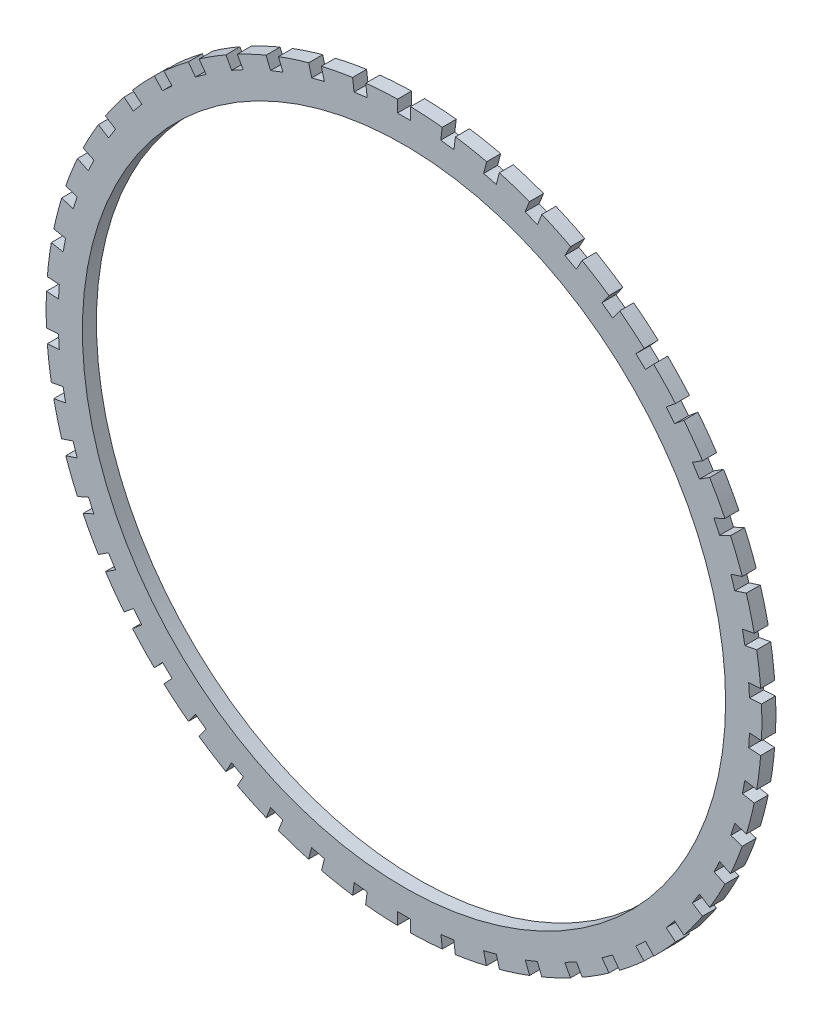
from build123d import *

# Parameters (mm, degrees)
SKETCH1_R           = 67.64782
BOSS_EXTRUDE1_DEPTH = 2.9464


with BuildPart() as part:
    # Sketch1 → Boss-Extrude1 (new body)
    with BuildSketch(Plane.XY):
        with BuildLine():
            Line((19.415182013, 70.101838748), (16.758164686, 70.784044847))
            Line((16.758164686, 70.784044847), (17.386728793, 73.232140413))
            ThreePointArc((17.386728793, 73.232140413), (14.116260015, 73.932238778), (10.817918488, 74.48635692))
            Line((10.817918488, 74.48635692), (10.501197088, 71.979248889))
            Line((10.501197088, 71.979248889), (7.729228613, 72.329429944))
            Line((7.729228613, 72.329429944), (8.045950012, 74.836537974))
            ThreePointArc((8.045950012, 74.836537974), (4.713428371, 75.120092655), (1.3716, 75.255321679))
            Line((1.3716, 75.255321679), (1.3716, 72.72782))
            Line((1.3716, 72.72782), (-1.3716, 72.72782))
            Line((-1.3716, 72.72782), (-1.3716, 75.255321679))
            ThreePointArc((-1.3716, 75.255321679), (-4.713428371, 75.120092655), (-8.045950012, 74.836537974))
            Line((-8.045950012, 74.836537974), (-7.729228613, 72.329429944))
            Line((-7.729228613, 72.329429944), (-10.501197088, 71.979248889))
            Line((-10.501197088, 71.979248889), (-10.817918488, 74.48635692))
            ThreePointArc((-10.817918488, 74.48635692), (-14.116260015, 73.932238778), (-17.386728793, 73.232140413))
            Line((-17.386728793, 73.232140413), (-16.758164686, 70.784044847))
            Line((-16.758164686, 70.784044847), (-19.415182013, 70.101838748))
            Line((-19.415182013, 70.101838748), (-20.043746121, 72.549934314))
            ThreePointArc((-20.043746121, 72.549934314), (-23.246954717, 71.587874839), (-26.404261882, 70.484464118))
            Line((-26.404261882, 70.484464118), (-25.473998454, 68.134886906))
            Line((-25.473998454, 68.134886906), (-28.071793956, 67.106346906))
            Line((-28.071793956, 67.106346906), (-29.002057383, 69.455924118))
            ThreePointArc((-29.002057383, 69.455924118), (-32.058971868, 68.098950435), (-35.052585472, 66.607514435))
            Line((-35.052585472, 66.607514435), (-33.834952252, 64.39264783))
            Line((-33.834952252, 64.39264783), (-36.238836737, 63.071101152))
            Line((-36.238836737, 63.071101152), (-37.456469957, 65.285967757))
            ThreePointArc((-37.456469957, 65.285967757), (-40.319789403, 63.557527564), (-43.103496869, 61.703592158))
            Line((-43.103496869, 61.703592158), (-41.618143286, 59.659178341))
            Line((-41.618143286, 59.659178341), (-43.878536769, 58.016906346))
            Line((-43.878536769, 58.016906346), (-45.363890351, 60.061320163))
            ThreePointArc((-45.363890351, 60.061320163), (-47.987300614, 57.986754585), (-50.515959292, 55.797693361))
            Line((-50.515959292, 55.797693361), (-48.785765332, 53.955223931))
            Line((-48.785765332, 53.955223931), (-50.785472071, 52.07737431))
            Line((-50.785472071, 52.07737431), (-52.51566603, 53.91984374))
            ThreePointArc((-52.51566603, 53.91984374), (-54.859183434, 51.533627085), (-57.094380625, 49.045656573))
            Line((-57.094380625, 49.045656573), (-55.147267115, 47.43486419))
            Line((-55.147267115, 47.43486419), (-56.928229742, 45.28205019))
            Line((-56.928229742, 45.28205019), (-58.875343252, 46.892842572))
            ThreePointArc((-58.875343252, 46.892842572), (-60.900410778, 44.231037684), (-62.805229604, 41.481898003))
            Line((-62.805229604, 41.481898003), (-60.671189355, 40.127594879))
            Line((-60.671189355, 40.127594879), (-62.141069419, 37.811434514))
            Line((-62.141069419, 37.811434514), (-64.275109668, 39.165737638))
            ThreePointArc((-64.275109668, 39.165737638), (-65.951573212, 36.271679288), (-67.497814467, 33.306002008))
            Line((-67.497814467, 33.306002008), (-65.211285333, 32.230043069))
            Line((-65.211285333, 32.230043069), (-66.400912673, 29.701956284))
            Line((-66.400912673, 29.701956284), (-68.687441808, 30.777915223))
            ThreePointArc((-68.687441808, 30.777915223), (-69.986924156, 27.696122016), (-71.148216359, 24.559642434))
            Line((-71.148216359, 24.559642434), (-68.744419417, 23.778601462))
            Line((-68.744419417, 23.778601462), (-69.592114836, 21.169663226))
            Line((-69.592114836, 21.169663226), (-71.995911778, 21.950704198))
            ThreePointArc((-71.995911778, 21.950704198), (-72.899983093, 18.730648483), (-73.660112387, 15.473608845))
            Line((-73.660112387, 15.473608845), (-71.177838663, 15.000089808))
            Line((-71.177838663, 15.000089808), (-71.701382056, 12.255579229))
            Line((-71.701382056, 12.255579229), (-74.18365578, 12.729098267))
            ThreePointArc((-74.18365578, 12.729098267), (-74.675901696, 9.420957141), (-75.020699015, 6.094214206))
            Line((-75.020699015, 6.094214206), (-72.498184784, 5.935511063))
            Line((-72.498184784, 5.935511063), (-72.670431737, 3.197724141))
            Line((-72.670431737, 3.197724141), (-75.192945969, 3.356427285))
            ThreePointArc((-75.192945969, 3.356427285), (-75.267818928, 0.012702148), (-75.194074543, -3.331048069))
            Line((-75.194074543, -3.331048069), (-72.672026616, -3.172374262))
            Line((-72.672026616, -3.172374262), (-72.496589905, -5.960860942))
            Line((-72.496589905, -5.960860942), (-75.018637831, -6.119534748))
            ThreePointArc((-75.018637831, -6.119534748), (-74.672717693, -9.446161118), (-74.179355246, -12.754135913))
            Line((-74.179355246, -12.754135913), (-71.69662257, -12.280529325))
            Line((-71.69662257, -12.280529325), (-71.182598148, -14.975139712))
            Line((-71.182598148, -14.975139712), (-73.665330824, -15.448746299))
            ThreePointArc((-73.665330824, -15.448746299), (-72.906300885, -18.706042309), (-72.00331645, -21.926402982))
            Line((-72.00331645, -21.926402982), (-69.599963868, -21.145506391))
            Line((-69.599963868, -21.145506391), (-68.736570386, -23.802758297))
            Line((-68.736570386, -23.802758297), (-71.139922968, -24.583654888))
            ThreePointArc((-71.139922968, -24.583654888), (-69.977572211, -27.719742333), (-68.677049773, -30.801096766))
            Line((-68.677049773, -30.801096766), (-66.390097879, -29.724938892))
            Line((-66.390097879, -29.724938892), (-65.222100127, -32.207060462))
            Line((-65.222100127, -32.207060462), (-67.509052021, -33.283218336))
            ThreePointArc((-67.509052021, -33.283218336), (-65.963811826, -36.249417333), (-64.288325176, -39.144041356))
            Line((-64.288325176, -39.144041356), (-62.154679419, -37.789988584))
            Line((-62.154679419, -37.789988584), (-60.657579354, -40.149040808))
            Line((-60.657579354, -40.149040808), (-62.791225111, -41.503093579))
            ThreePointArc((-62.791225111, -41.503093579), (-60.885478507, -44.251590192), (-58.859512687, -46.912711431))
            Line((-58.859512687, -46.912711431), (-56.912039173, -45.301621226))
            Line((-56.912039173, -45.301621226), (-55.163457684, -47.415293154))
            Line((-55.163457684, -47.415293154), (-57.110931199, -49.026383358))
            ThreePointArc((-57.110931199, -49.026383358), (-54.876573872, -51.515108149), (-52.533861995, -53.902115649))
            Line((-52.533861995, -53.902115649), (-50.803987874, -52.059986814))
            Line((-50.803987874, -52.059986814), (-48.767249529, -53.972611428))
            Line((-48.767249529, -53.972611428), (-50.49712365, -55.814740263))
            ThreePointArc((-50.49712365, -55.814740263), (-47.967726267, -58.002947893), (-45.343615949, -60.076627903))
            Line((-45.343615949, -60.076627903), (-43.857987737, -58.031836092))
            Line((-43.857987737, -58.031836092), (-41.638692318, -59.644248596))
            Line((-41.638692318, -59.644248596), (-43.12432053, -61.689040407))
            ThreePointArc((-43.12432053, -61.689040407), (-40.34123896, -63.543915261), (-37.478503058, -65.273321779))
            Line((-37.478503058, -65.273321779), (-36.261094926, -63.058864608))
            Line((-36.261094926, -63.058864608), (-33.812694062, -64.404884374))
            Line((-33.812694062, -64.404884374), (-35.030102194, -66.619341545))
            ThreePointArc((-35.030102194, -66.619341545), (-32.035985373, -68.109767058), (-28.978613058, -69.465708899))
            Line((-28.978613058, -69.465708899), (-28.048177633, -67.115697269))
            Line((-28.048177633, -67.115697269), (-25.497614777, -68.125536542))
            Line((-25.497614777, -68.125536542), (-26.428050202, -70.475548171))
            ThreePointArc((-26.428050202, -70.475548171), (-23.271115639, -71.580024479), (-20.068231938, -72.543165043))
            Line((-20.068231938, -72.543165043), (-19.439784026, -70.095522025))
            Line((-19.439784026, -70.095522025), (-16.733562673, -70.79036157))
            Line((-16.733562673, -70.79036157), (-17.362010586, -73.238004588))
            ThreePointArc((-17.362010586, -73.238004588), (-14.091305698, -73.936999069), (-10.792777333, -74.490003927))
            Line((-10.792777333, -74.490003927), (-10.475997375, -71.982432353))
            Line((-10.475997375, -71.982432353), (-7.754428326, -72.32624648))
            Line((-7.754428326, -72.32624648), (-8.071208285, -74.833818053))
            ThreePointArc((-8.071208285, -74.833818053), (-4.738782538, -75.118497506), (-1.397, -75.254854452))
            Line((-1.397, -75.254854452), (-1.397, -72.72782))
            Line((-1.397, -72.72782), (1.397, -72.72782))
            Line((1.397, -72.72782), (1.397, -75.254854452))
            ThreePointArc((1.397, -75.254854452), (4.738782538, -75.118497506), (8.071208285, -74.833818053))
            Line((8.071208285, -74.833818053), (7.754428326, -72.32624648))
            Line((7.754428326, -72.32624648), (10.475997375, -71.982432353))
            Line((10.475997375, -71.982432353), (10.792777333, -74.490003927))
            ThreePointArc((10.792777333, -74.490003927), (14.091305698, -73.936999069), (17.362010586, -73.238004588))
            Line((17.362010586, -73.238004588), (16.733562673, -70.79036157))
            Line((16.733562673, -70.79036157), (19.439784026, -70.095522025))
            Line((19.439784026, -70.095522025), (20.068231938, -72.543165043))
            ThreePointArc((20.068231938, -72.543165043), (23.271115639, -71.580024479), (26.428050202, -70.475548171))
            Line((26.428050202, -70.475548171), (25.497614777, -68.125536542))
            Line((25.497614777, -68.125536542), (28.048177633, -67.115697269))
            Line((28.048177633, -67.115697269), (28.978613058, -69.465708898))
            ThreePointArc((28.978613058, -69.465708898), (32.035985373, -68.109767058), (35.030102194, -66.619341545))
            Line((35.030102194, -66.619341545), (33.812694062, -64.404884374))
            Line((33.812694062, -64.404884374), (36.261094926, -63.058864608))
            Line((36.261094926, -63.058864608), (37.478503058, -65.273321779))
            ThreePointArc((37.478503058, -65.273321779), (40.34123896, -63.543915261), (43.12432053, -61.689040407))
            Line((43.12432053, -61.689040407), (41.638692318, -59.644248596))
            Line((41.638692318, -59.644248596), (43.857987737, -58.031836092))
            Line((43.857987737, -58.031836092), (45.343615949, -60.076627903))
            ThreePointArc((45.343615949, -60.076627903), (47.967726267, -58.002947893), (50.49712365, -55.814740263))
            Line((50.49712365, -55.814740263), (48.767249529, -53.972611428))
            Line((48.767249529, -53.972611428), (50.803987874, -52.059986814))
            Line((50.803987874, -52.059986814), (52.533861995, -53.90211565))
            ThreePointArc((52.533861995, -53.90211565), (54.876573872, -51.515108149), (57.110931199, -49.026383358))
            Line((57.110931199, -49.026383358), (55.163457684, -47.415293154))
            Line((55.163457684, -47.415293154), (56.912039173, -45.301621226))
            Line((56.912039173, -45.301621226), (58.859512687, -46.912711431))
            ThreePointArc((58.859512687, -46.912711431), (60.885478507, -44.251590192), (62.791225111, -41.503093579))
            Line((62.791225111, -41.503093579), (60.657579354, -40.149040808))
            Line((60.657579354, -40.149040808), (62.154679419, -37.789988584))
            Line((62.154679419, -37.789988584), (64.288325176, -39.144041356))
            ThreePointArc((64.288325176, -39.144041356), (65.963811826, -36.249417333), (67.509052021, -33.283218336))
            Line((67.509052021, -33.283218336), (65.222100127, -32.207060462))
            Line((65.222100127, -32.207060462), (66.390097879, -29.724938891))
            Line((66.390097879, -29.724938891), (68.677049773, -30.801096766))
            ThreePointArc((68.677049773, -30.801096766), (69.977572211, -27.719742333), (71.139922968, -24.583654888))
            Line((71.139922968, -24.583654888), (68.736570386, -23.802758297))
            Line((68.736570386, -23.802758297), (69.599963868, -21.145506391))
            Line((69.599963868, -21.145506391), (72.00331645, -21.926402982))
            ThreePointArc((72.00331645, -21.926402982), (72.906300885, -18.706042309), (73.665330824, -15.448746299))
            Line((73.665330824, -15.448746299), (71.182598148, -14.975139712))
            Line((71.182598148, -14.975139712), (71.69662257, -12.280529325))
            Line((71.69662257, -12.280529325), (74.179355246, -12.754135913))
            ThreePointArc((74.179355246, -12.754135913), (74.672717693, -9.446161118), (75.018637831, -6.119534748))
            Line((75.018637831, -6.119534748), (72.496589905, -5.960860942))
            Line((72.496589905, -5.960860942), (72.672026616, -3.172374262))
            Line((72.672026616, -3.172374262), (75.194074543, -3.331048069))
            ThreePointArc((75.194074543, -3.331048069), (75.249381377, -1.665932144), (75.26782, 0))
            ThreePointArc((75.26782, 0), (75.249099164, 1.678631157), (75.192945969, 3.356427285))
            Line((75.192945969, 3.356427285), (72.670431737, 3.197724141))
            Line((72.670431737, 3.197724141), (72.498184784, 5.935511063))
            Line((72.498184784, 5.935511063), (75.020699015, 6.094214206))
            ThreePointArc((75.020699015, 6.094214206), (74.675901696, 9.420957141), (74.18365578, 12.729098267))
            Line((74.18365578, 12.729098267), (71.701382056, 12.255579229))
            Line((71.701382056, 12.255579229), (71.177838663, 15.000089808))
            Line((71.177838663, 15.000089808), (73.660112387, 15.473608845))
            ThreePointArc((73.660112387, 15.473608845), (72.899983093, 18.730648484), (71.995911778, 21.950704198))
            Line((71.995911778, 21.950704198), (69.592114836, 21.169663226))
            Line((69.592114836, 21.169663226), (68.744419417, 23.778601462))
            Line((68.744419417, 23.778601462), (71.148216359, 24.559642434))
            ThreePointArc((71.148216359, 24.559642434), (69.986924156, 27.696122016), (68.687441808, 30.777915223))
            Line((68.687441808, 30.777915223), (66.400912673, 29.701956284))
            Line((66.400912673, 29.701956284), (65.211285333, 32.230043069))
            Line((65.211285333, 32.230043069), (67.497814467, 33.306002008))
            ThreePointArc((67.497814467, 33.306002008), (65.951573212, 36.271679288), (64.275109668, 39.165737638))
            Line((64.275109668, 39.165737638), (62.141069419, 37.811434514))
            Line((62.141069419, 37.811434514), (60.671189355, 40.127594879))
            Line((60.671189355, 40.127594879), (62.805229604, 41.481898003))
            ThreePointArc((62.805229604, 41.481898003), (60.900410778, 44.231037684), (58.875343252, 46.892842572))
            Line((58.875343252, 46.892842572), (56.928229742, 45.28205019))
            Line((56.928229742, 45.28205019), (55.147267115, 47.43486419))
            Line((55.147267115, 47.43486419), (57.094380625, 49.045656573))
            ThreePointArc((57.094380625, 49.045656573), (54.859183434, 51.533627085), (52.51566603, 53.91984374))
            Line((52.51566603, 53.91984374), (50.785472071, 52.07737431))
            Line((50.785472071, 52.07737431), (48.785765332, 53.955223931))
            Line((48.785765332, 53.955223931), (50.515959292, 55.797693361))
            ThreePointArc((50.515959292, 55.797693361), (47.987300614, 57.986754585), (45.363890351, 60.061320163))
            Line((45.363890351, 60.061320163), (43.878536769, 58.016906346))
            Line((43.878536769, 58.016906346), (41.618143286, 59.659178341))
            Line((41.618143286, 59.659178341), (43.103496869, 61.703592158))
            ThreePointArc((43.103496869, 61.703592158), (40.319789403, 63.557527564), (37.456469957, 65.285967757))
            Line((37.456469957, 65.285967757), (36.238836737, 63.071101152))
            Line((36.238836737, 63.071101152), (33.834952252, 64.39264783))
            Line((33.834952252, 64.39264783), (35.052585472, 66.607514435))
            ThreePointArc((35.052585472, 66.607514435), (32.058971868, 68.098950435), (29.002057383, 69.455924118))
            Line((29.002057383, 69.455924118), (28.071793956, 67.106346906))
            Line((28.071793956, 67.106346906), (25.473998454, 68.134886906))
            Line((25.473998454, 68.134886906), (26.404261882, 70.484464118))
            ThreePointArc((26.404261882, 70.484464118), (23.246954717, 71.587874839), (20.043746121, 72.549934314))
            Line((20.043746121, 72.549934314), (19.415182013, 70.101838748))
        make_face()
        Circle(SKETCH1_R, mode=Mode.SUBTRACT)
    extrude(amount=BOSS_EXTRUDE1_DEPTH)


solid = part.part
